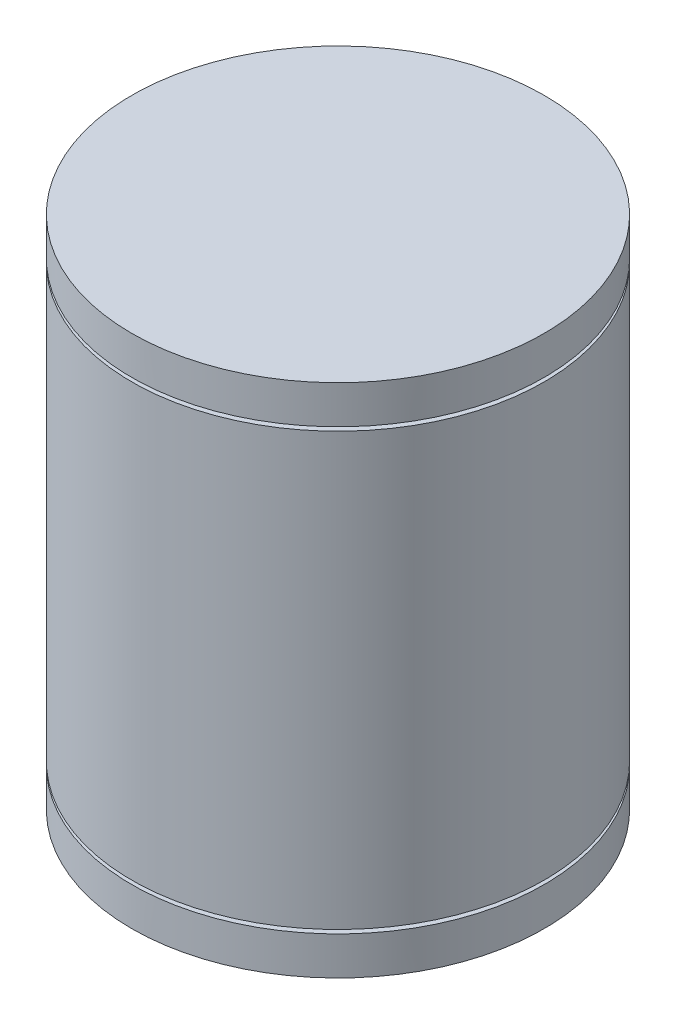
from build123d import *

# Parameters (mm, degrees)
CROQUIS1_R              = 54
SALIENTE_EXTRUIR1_DEPTH = 135
CROQUIS2_R              = 46
CORTAR_EXTRUIR1_DEPTH   = 10
CROQUIS3_R              = 54
CROQUIS3_R_2            = 52
CORTAR_EXTRUIR2_DEPTH   = 1


with BuildPart() as part:
    # Croquis1 → Saliente-Extruir1 (new body)
    with BuildSketch(Plane(origin=(0, 0, 0), x_dir=(1, 0, 0), z_dir=(0, 1, 0))):
        with Locations(Location((0, 0, 0), (0, 0, 270))):
            Circle(CROQUIS1_R)
    extrude(amount=SALIENTE_EXTRUIR1_DEPTH)

    # Croquis2 → Cortar-Extruir1 (cut)
    with BuildSketch(Plane.XZ):
        with Locations(Location((0, 0, 0), (0, 0, 270))):
            Circle(CROQUIS2_R)
    extrude(amount=-CORTAR_EXTRUIR1_DEPTH, mode=Mode.SUBTRACT)

    # Croquis3 → Cortar-Extruir2 (cut)
    with BuildSketch(Plane(origin=(0, 10, 0), x_dir=(-1, 0, 0), z_dir=(0, -1, 0))):
        with Locations(Location((0, 0, 0), (0, 0, 90))):
            Circle(CROQUIS3_R)
        with Locations(Location((0, 0, 0), (0, 0, 90))):
            Circle(CROQUIS3_R_2, mode=Mode.SUBTRACT)
    cortar_extruir2 = extrude(amount=-CORTAR_EXTRUIR2_DEPTH, mode=Mode.SUBTRACT)

    # Simetr_a1: Cortar-Extruir2 across plane
    add(cortar_extruir2.mirror(Plane(origin=(0, 67.5, 0), x_dir=(0, 0, 1), z_dir=(0, -1, 0))), mode=Mode.SUBTRACT)


solid = part.part
